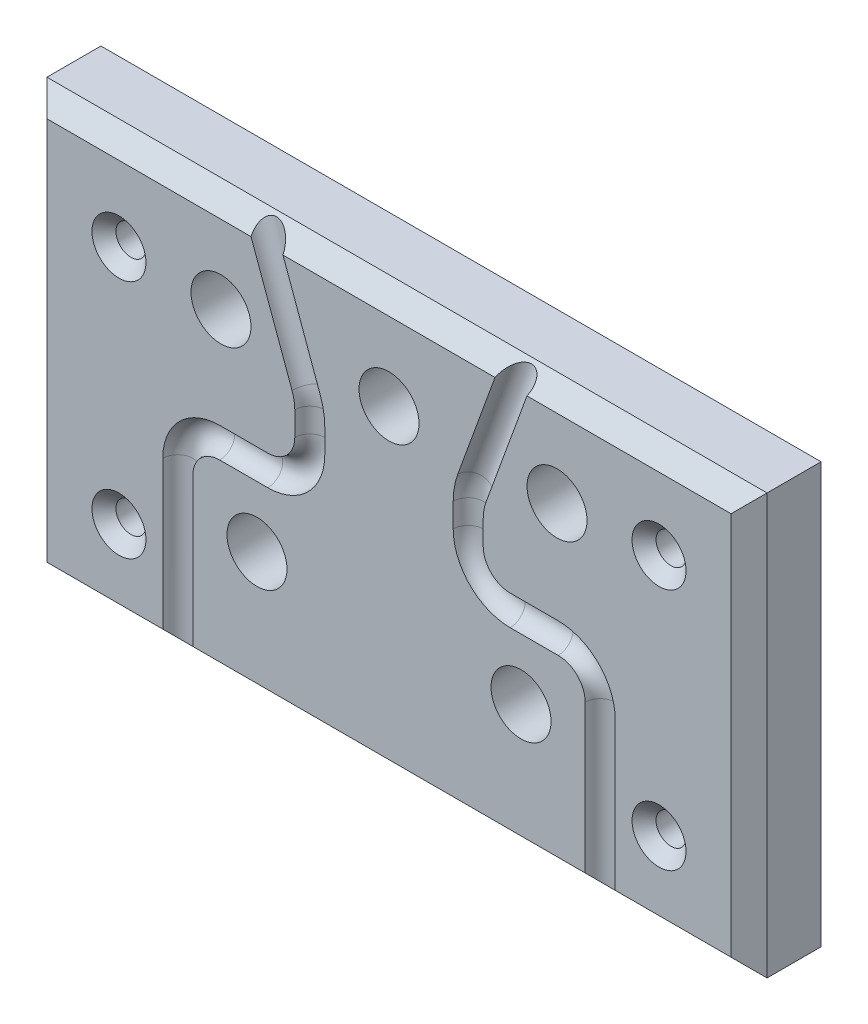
ISO-10303-21;
HEADER;
FILE_DESCRIPTION(('STEP AP214'),'2;1');
FILE_NAME('part.step','',(''),(''),'','','');
FILE_SCHEMA(('AUTOMOTIVE_DESIGN { 1 0 10303 214 1 1 1 1 }'));
ENDSEC;
DATA;
#1=APPLICATION_CONTEXT('core data for automotive mechanical design processes');
#2=APPLICATION_PROTOCOL_DEFINITION('international standard','automotive_design',2000,#1);
#3=PRODUCT_CONTEXT('',#1,'mechanical');
#4=PRODUCT('Part','Part','',(#3));
#5=PRODUCT_RELATED_PRODUCT_CATEGORY('part','',(#4));
#6=PRODUCT_DEFINITION_FORMATION('','',#4);
#7=PRODUCT_DEFINITION_CONTEXT('part definition',#1,'design');
#8=PRODUCT_DEFINITION('design','',#6,#7);
#9=PRODUCT_DEFINITION_SHAPE('','',#8);
#10=(LENGTH_UNIT() NAMED_UNIT(*) SI_UNIT(.MILLI.,.METRE.));
#11=(NAMED_UNIT(*) PLANE_ANGLE_UNIT() SI_UNIT($,.RADIAN.));
#12=(NAMED_UNIT(*) SI_UNIT($,.STERADIAN.) SOLID_ANGLE_UNIT());
#13=UNCERTAINTY_MEASURE_WITH_UNIT(LENGTH_MEASURE(1.E-05),#10,'distance_accuracy_value','');
#14=(GEOMETRIC_REPRESENTATION_CONTEXT(3) GLOBAL_UNCERTAINTY_ASSIGNED_CONTEXT((#13)) GLOBAL_UNIT_ASSIGNED_CONTEXT((#10,
#11,#12)) REPRESENTATION_CONTEXT('',''));
#15=CARTESIAN_POINT('',(0.,0.,0.));
#16=DIRECTION('',(0.,0.,1.));
#17=DIRECTION('',(1.,0.,0.));
#18=AXIS2_PLACEMENT_3D('',#15,#16,#17);
#19=CARTESIAN_POINT('',(-60.,-17.0716066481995,12.));
#20=DIRECTION('',(0.,0.,1.));
#21=DIRECTION('',(1.,0.,0.));
#22=AXIS2_PLACEMENT_3D('',#19,#20,#21);
#23=PLANE('',#22);
#24=CARTESIAN_POINT('',(-28.,36.9283933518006,12.));
#25=DIRECTION('',(0.,0.,1.));
#26=DIRECTION('',(1.,0.,0.));
#27=AXIS2_PLACEMENT_3D('',#24,#25,#26);
#28=CIRCLE('',#27,5.);
#29=CARTESIAN_POINT('',(-23.,36.9283933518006,12.));
#30=VERTEX_POINT('',#29);
#31=EDGE_CURVE('E382',#30,#30,#28,.T.);
#32=ORIENTED_EDGE('',*,*,#31,.F.);
#33=EDGE_LOOP('',(#32));
#34=FACE_BOUND('',#33,.T.);
#35=CARTESIAN_POINT('',(-45.,-2.57160664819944,12.));
#36=DIRECTION('',(0.,0.,1.));
#37=DIRECTION('',(1.,0.,0.));
#38=AXIS2_PLACEMENT_3D('',#35,#36,#37);
#39=CIRCLE('',#38,4.5);
#40=CARTESIAN_POINT('',(-40.5,-2.57160664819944,12.));
#41=VERTEX_POINT('',#40);
#42=EDGE_CURVE('E316',#41,#41,#39,.T.);
#43=ORIENTED_EDGE('',*,*,#42,.F.);
#44=EDGE_LOOP('',(#43));
#45=FACE_BOUND('',#44,.T.);
#46=CARTESIAN_POINT('',(-45.,37.4283933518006,12.));
#47=DIRECTION('',(0.,0.,1.));
#48=DIRECTION('',(1.,0.,0.));
#49=AXIS2_PLACEMENT_3D('',#46,#47,#48);
#50=CIRCLE('',#49,4.5);
#51=CARTESIAN_POINT('',(-40.5,37.4283933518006,12.));
#52=VERTEX_POINT('',#51);
#53=EDGE_CURVE('E289',#52,#52,#50,.T.);
#54=ORIENTED_EDGE('',*,*,#53,.F.);
#55=EDGE_LOOP('',(#54));
#56=FACE_BOUND('',#55,.T.);
#57=CARTESIAN_POINT('',(-23.1999999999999,28.5783933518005,12.));
#58=DIRECTION('',(0.,0.,-1.));
#59=DIRECTION('',(-1.,0.,0.));
#60=AXIS2_PLACEMENT_3D('',#57,#58,#59);
#61=CIRCLE('',#60,7.49999999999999);
#62=CARTESIAN_POINT('',(-16.1523053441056,31.1435444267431,12.));
#63=VERTEX_POINT('',#62);
#64=CARTESIAN_POINT('',(-15.7,28.5783933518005,12.));
#65=VERTEX_POINT('',#64);
#66=EDGE_CURVE('E184',#63,#65,#61,.T.);
#67=ORIENTED_EDGE('',*,*,#66,.F.);
#68=DIRECTION('',(0.342020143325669,-0.939692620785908,0.));
#69=VECTOR('',#68,1.);
#70=CARTESIAN_POINT('',(-28.2830267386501,64.472427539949,12.));
#71=LINE('',#70,#69);
#72=CARTESIAN_POINT('',(-22.9894312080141,49.9283933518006,12.));
#73=VERTEX_POINT('',#72);
#74=EDGE_CURVE('E190',#63,#73,#71,.F.);
#75=ORIENTED_EDGE('',*,*,#74,.T.);
#76=DIRECTION('',(-1.,0.,0.));
#77=VECTOR('',#76,1.);
#78=CARTESIAN_POINT('',(-60.,49.9283933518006,12.));
#79=LINE('',#78,#77);
#80=CARTESIAN_POINT('',(-57.,49.9283933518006,12.));
#81=VERTEX_POINT('',#80);
#82=EDGE_CURVE('E364',#73,#81,#79,.T.);
#83=ORIENTED_EDGE('',*,*,#82,.T.);
#84=DIRECTION('',(0.,-1.,0.));
#85=VECTOR('',#84,1.);
#86=CARTESIAN_POINT('',(-57.,-17.0716066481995,12.));
#87=LINE('',#86,#85);
#88=CARTESIAN_POINT('',(-57.,-14.0716066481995,12.));
#89=VERTEX_POINT('',#88);
#90=EDGE_CURVE('E356',#81,#89,#87,.T.);
#91=ORIENTED_EDGE('',*,*,#90,.T.);
#92=DIRECTION('',(1.,0.,0.));
#93=VECTOR('',#92,1.);
#94=CARTESIAN_POINT('',(60.,-14.0716066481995,12.));
#95=LINE('',#94,#93);
#96=CARTESIAN_POINT('',(-37.7,-14.0716066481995,12.));
#97=VERTEX_POINT('',#96);
#98=EDGE_CURVE('E359',#89,#97,#95,.T.);
#99=ORIENTED_EDGE('',*,*,#98,.T.);
#100=DIRECTION('',(0.,-1.,0.));
#101=VECTOR('',#100,1.);
#102=CARTESIAN_POINT('',(-37.7,10.5783933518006,12.));
#103=LINE('',#102,#101);
#104=CARTESIAN_POINT('',(-37.7,10.5783933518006,12.));
#105=VERTEX_POINT('',#104);
#106=EDGE_CURVE('E45',#97,#105,#103,.F.);
#107=ORIENTED_EDGE('',*,*,#106,.T.);
#108=CARTESIAN_POINT('',(-28.2,10.5783933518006,12.));
#109=DIRECTION('',(0.,0.,1.));
#110=DIRECTION('',(1.,0.,0.));
#111=AXIS2_PLACEMENT_3D('',#108,#109,#110);
#112=CIRCLE('',#111,9.50000000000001);
#113=CARTESIAN_POINT('',(-28.2,20.0783933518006,12.));
#114=VERTEX_POINT('',#113);
#115=EDGE_CURVE('E233',#114,#105,#112,.T.);
#116=ORIENTED_EDGE('',*,*,#115,.F.);
#117=DIRECTION('',(-1.,0.,0.));
#118=VECTOR('',#117,1.);
#119=CARTESIAN_POINT('',(-20.2,20.0783933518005,12.));
#120=LINE('',#119,#118);
#121=CARTESIAN_POINT('',(-20.2,20.0783933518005,12.));
#122=VERTEX_POINT('',#121);
#123=EDGE_CURVE('E225',#114,#122,#120,.F.);
#124=ORIENTED_EDGE('',*,*,#123,.T.);
#125=CARTESIAN_POINT('',(-20.2,24.5783933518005,12.));
#126=DIRECTION('',(0.,0.,-1.));
#127=DIRECTION('',(-1.,0.,0.));
#128=AXIS2_PLACEMENT_3D('',#125,#126,#127);
#129=CIRCLE('',#128,4.5);
#130=CARTESIAN_POINT('',(-15.7,24.5783933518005,12.));
#131=VERTEX_POINT('',#130);
#132=EDGE_CURVE('E214',#131,#122,#129,.T.);
#133=ORIENTED_EDGE('',*,*,#132,.F.);
#134=DIRECTION('',(0.,-1.,0.));
#135=VECTOR('',#134,1.);
#136=CARTESIAN_POINT('',(-15.7,28.5783933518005,12.));
#137=LINE('',#136,#135);
#138=EDGE_CURVE('E202',#131,#65,#137,.F.);
#139=ORIENTED_EDGE('',*,*,#138,.T.);
#140=EDGE_LOOP('',(#67,#75,#83,#91,#99,#107,#116,#124,#133,#139));
#141=FACE_BOUND('',#140,.T.);
#142=ADVANCED_FACE('F28',(#34,#45,#56,#141),#23,.T.);
#143=CARTESIAN_POINT('',(0.,36.9283933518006,12.));
#144=DIRECTION('',(0.,0.,1.));
#145=DIRECTION('',(1.,0.,0.));
#146=AXIS2_PLACEMENT_3D('',#143,#144,#145);
#147=CIRCLE('',#146,5.);
#148=CARTESIAN_POINT('',(5.,36.9283933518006,12.));
#149=VERTEX_POINT('',#148);
#150=EDGE_CURVE('E402',#149,#149,#147,.T.);
#151=ORIENTED_EDGE('',*,*,#150,.F.);
#152=EDGE_LOOP('',(#151));
#153=FACE_BOUND('',#152,.T.);
#154=CARTESIAN_POINT('',(22.,4.92839335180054,12.));
#155=DIRECTION('',(0.,0.,1.));
#156=DIRECTION('',(1.,0.,0.));
#157=AXIS2_PLACEMENT_3D('',#154,#155,#156);
#158=CIRCLE('',#157,5.);
#159=CARTESIAN_POINT('',(27.,4.92839335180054,12.));
#160=VERTEX_POINT('',#159);
#161=EDGE_CURVE('E392',#160,#160,#158,.T.);
#162=ORIENTED_EDGE('',*,*,#161,.F.);
#163=EDGE_LOOP('',(#162));
#164=FACE_BOUND('',#163,.T.);
#165=CARTESIAN_POINT('',(-22.,4.92839335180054,12.));
#166=DIRECTION('',(0.,0.,1.));
#167=DIRECTION('',(1.,0.,0.));
#168=AXIS2_PLACEMENT_3D('',#165,#166,#167);
#169=CIRCLE('',#168,5.);
#170=CARTESIAN_POINT('',(-17.,4.92839335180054,12.));
#171=VERTEX_POINT('',#170);
#172=EDGE_CURVE('E389',#171,#171,#169,.T.);
#173=ORIENTED_EDGE('',*,*,#172,.F.);
#174=EDGE_LOOP('',(#173));
#175=FACE_BOUND('',#174,.T.);
#176=CARTESIAN_POINT('',(17.6685423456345,49.9283933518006,12.));
#177=VERTEX_POINT('',#176);
#178=CARTESIAN_POINT('',(-17.6685423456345,49.9283933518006,12.));
#179=VERTEX_POINT('',#178);
#180=EDGE_CURVE('E369',#177,#179,#79,.T.);
#181=ORIENTED_EDGE('',*,*,#180,.T.);
#182=DIRECTION('',(0.342020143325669,-0.939692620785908,0.));
#183=VECTOR('',#182,1.);
#184=CARTESIAN_POINT('',(-23.5845636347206,66.1825282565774,12.));
#185=LINE('',#184,#183);
#186=CARTESIAN_POINT('',(-11.4538422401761,32.8536451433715,12.));
#187=VERTEX_POINT('',#186);
#188=EDGE_CURVE('E198',#179,#187,#185,.T.);
#189=ORIENTED_EDGE('',*,*,#188,.T.);
#190=CARTESIAN_POINT('',(-23.1999999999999,28.5783933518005,12.));
#191=DIRECTION('',(0.,0.,1.));
#192=DIRECTION('',(1.,0.,0.));
#193=AXIS2_PLACEMENT_3D('',#190,#191,#192);
#194=CIRCLE('',#193,12.5);
#195=CARTESIAN_POINT('',(-10.7,28.5783933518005,12.));
#196=VERTEX_POINT('',#195);
#197=EDGE_CURVE('E187',#196,#187,#194,.T.);
#198=ORIENTED_EDGE('',*,*,#197,.F.);
#199=DIRECTION('',(0.,-1.,0.));
#200=VECTOR('',#199,1.);
#201=CARTESIAN_POINT('',(-10.7,28.5783933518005,12.));
#202=LINE('',#201,#200);
#203=CARTESIAN_POINT('',(-10.7,24.5783933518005,12.));
#204=VERTEX_POINT('',#203);
#205=EDGE_CURVE('E208',#196,#204,#202,.T.);
#206=ORIENTED_EDGE('',*,*,#205,.T.);
#207=CARTESIAN_POINT('',(-20.2,24.5783933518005,12.));
#208=DIRECTION('',(0.,0.,1.));
#209=DIRECTION('',(1.,0.,0.));
#210=AXIS2_PLACEMENT_3D('',#207,#208,#209);
#211=CIRCLE('',#210,9.5);
#212=CARTESIAN_POINT('',(-20.2,15.0783933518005,12.));
#213=VERTEX_POINT('',#212);
#214=EDGE_CURVE('E217',#213,#204,#211,.T.);
#215=ORIENTED_EDGE('',*,*,#214,.F.);
#216=DIRECTION('',(-1.,0.,0.));
#217=VECTOR('',#216,1.);
#218=CARTESIAN_POINT('',(-20.2,15.0783933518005,12.));
#219=LINE('',#218,#217);
#220=CARTESIAN_POINT('',(-28.2,15.0783933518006,12.));
#221=VERTEX_POINT('',#220);
#222=EDGE_CURVE('E222',#213,#221,#219,.T.);
#223=ORIENTED_EDGE('',*,*,#222,.T.);
#224=CARTESIAN_POINT('',(-28.2,10.5783933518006,12.));
#225=DIRECTION('',(0.,0.,-1.));
#226=DIRECTION('',(-1.,0.,0.));
#227=AXIS2_PLACEMENT_3D('',#224,#225,#226);
#228=CIRCLE('',#227,4.5);
#229=CARTESIAN_POINT('',(-32.7,10.5783933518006,12.));
#230=VERTEX_POINT('',#229);
#231=EDGE_CURVE('E230',#230,#221,#228,.T.);
#232=ORIENTED_EDGE('',*,*,#231,.F.);
#233=DIRECTION('',(0.,-1.,0.));
#234=VECTOR('',#233,1.);
#235=CARTESIAN_POINT('',(-32.7,10.5783933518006,12.));
#236=LINE('',#235,#234);
#237=CARTESIAN_POINT('',(-32.7,-14.0716066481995,12.));
#238=VERTEX_POINT('',#237);
#239=EDGE_CURVE('E238',#230,#238,#236,.T.);
#240=ORIENTED_EDGE('',*,*,#239,.T.);
#241=CARTESIAN_POINT('',(32.7,-14.0716066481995,12.));
#242=VERTEX_POINT('',#241);
#243=EDGE_CURVE('E52',#238,#242,#95,.T.);
#244=ORIENTED_EDGE('',*,*,#243,.T.);
#245=DIRECTION('',(0.,-1.,0.));
#246=VECTOR('',#245,1.);
#247=CARTESIAN_POINT('',(32.7,10.5783933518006,12.));
#248=LINE('',#247,#246);
#249=CARTESIAN_POINT('',(32.7,10.5783933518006,12.));
#250=VERTEX_POINT('',#249);
#251=EDGE_CURVE('E287',#250,#242,#248,.T.);
#252=ORIENTED_EDGE('',*,*,#251,.F.);
#253=CARTESIAN_POINT('',(28.2,10.5783933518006,12.));
#254=DIRECTION('',(0.,0.,-1.));
#255=DIRECTION('',(-1.,0.,0.));
#256=AXIS2_PLACEMENT_3D('',#253,#254,#255);
#257=CIRCLE('',#256,4.5);
#258=CARTESIAN_POINT('',(28.2,15.0783933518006,12.));
#259=VERTEX_POINT('',#258);
#260=EDGE_CURVE('E277',#259,#250,#257,.T.);
#261=ORIENTED_EDGE('',*,*,#260,.F.);
#262=DIRECTION('',(1.,0.,0.));
#263=VECTOR('',#262,1.);
#264=CARTESIAN_POINT('',(20.2,15.0783933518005,12.));
#265=LINE('',#264,#263);
#266=CARTESIAN_POINT('',(20.2,15.0783933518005,12.));
#267=VERTEX_POINT('',#266);
#268=EDGE_CURVE('E273',#267,#259,#265,.T.);
#269=ORIENTED_EDGE('',*,*,#268,.F.);
#270=CARTESIAN_POINT('',(20.2,24.5783933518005,12.));
#271=DIRECTION('',(0.,0.,1.));
#272=DIRECTION('',(1.,0.,0.));
#273=AXIS2_PLACEMENT_3D('',#270,#271,#272);
#274=CIRCLE('',#273,9.5);
#275=CARTESIAN_POINT('',(10.7,24.5783933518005,12.));
#276=VERTEX_POINT('',#275);
#277=EDGE_CURVE('E266',#276,#267,#274,.T.);
#278=ORIENTED_EDGE('',*,*,#277,.F.);
#279=DIRECTION('',(0.,-1.,0.));
#280=VECTOR('',#279,1.);
#281=CARTESIAN_POINT('',(10.7,28.5783933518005,12.));
#282=LINE('',#281,#280);
#283=CARTESIAN_POINT('',(10.7,28.5783933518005,12.));
#284=VERTEX_POINT('',#283);
#285=EDGE_CURVE('E259',#284,#276,#282,.T.);
#286=ORIENTED_EDGE('',*,*,#285,.F.);
#287=CARTESIAN_POINT('',(23.1999999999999,28.5783933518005,12.));
#288=DIRECTION('',(0.,0.,1.));
#289=DIRECTION('',(1.,0.,0.));
#290=AXIS2_PLACEMENT_3D('',#287,#288,#289);
#291=CIRCLE('',#290,12.5);
#292=CARTESIAN_POINT('',(11.4538422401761,32.8536451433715,12.));
#293=VERTEX_POINT('',#292);
#294=EDGE_CURVE('E252',#293,#284,#291,.T.);
#295=ORIENTED_EDGE('',*,*,#294,.F.);
#296=DIRECTION('',(-0.342020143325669,-0.939692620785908,0.));
#297=VECTOR('',#296,1.);
#298=CARTESIAN_POINT('',(23.5845636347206,66.1825282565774,12.));
#299=LINE('',#298,#297);
#300=EDGE_CURVE('E245',#177,#293,#299,.T.);
#301=ORIENTED_EDGE('',*,*,#300,.F.);
#302=EDGE_LOOP('',(#181,#189,#198,#206,#215,#223,#232,#240,#244,#252,#261,#269,#278,#286,#295,#301));
#303=FACE_BOUND('',#302,.T.);
#304=ADVANCED_FACE('F411',(#153,#164,#175,#303),#23,.T.);
#305=CARTESIAN_POINT('',(-60.,49.9283933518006,12.));
#306=DIRECTION('',(0.,0.70710678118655,0.707106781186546));
#307=DIRECTION('',(0.,-0.707106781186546,0.70710678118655));
#308=AXIS2_PLACEMENT_3D('',#305,#306,#307);
#309=PLANE('',#308);
#310=ORIENTED_EDGE('',*,*,#82,.F.);
#311=CARTESIAN_POINT('',(-20.3289867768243,49.9283933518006,12.));
#312=DIRECTION('',(0.,0.70710678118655,0.707106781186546));
#313=DIRECTION('',(0.457661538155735,-0.628707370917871,0.628707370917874));
#314=AXIS2_PLACEMENT_3D('',#311,#312,#313);
#315=ELLIPSE('',#314,3.76243659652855,2.5);
#316=EDGE_CURVE('E195',#73,#179,#315,.F.);
#317=ORIENTED_EDGE('',*,*,#316,.T.);
#318=ORIENTED_EDGE('',*,*,#180,.F.);
#319=CARTESIAN_POINT('',(20.3289867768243,49.9283933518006,12.));
#320=DIRECTION('',(0.,0.70710678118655,0.707106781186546));
#321=DIRECTION('',(-0.457661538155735,-0.628707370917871,0.628707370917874));
#322=AXIS2_PLACEMENT_3D('',#319,#320,#321);
#323=ELLIPSE('',#322,3.76243659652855,2.5);
#324=CARTESIAN_POINT('',(22.9894312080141,49.9283933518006,12.));
#325=VERTEX_POINT('',#324);
#326=EDGE_CURVE('E241',#325,#177,#323,.T.);
#327=ORIENTED_EDGE('',*,*,#326,.F.);
#328=CARTESIAN_POINT('',(57.,49.9283933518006,12.));
#329=VERTEX_POINT('',#328);
#330=EDGE_CURVE('E365',#329,#325,#79,.T.);
#331=ORIENTED_EDGE('',*,*,#330,.F.);
#332=DIRECTION('',(-0.577350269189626,-0.577350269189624,0.577350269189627));
#333=VECTOR('',#332,1.);
#334=CARTESIAN_POINT('',(34.6666666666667,27.5950600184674,34.3333333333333));
#335=LINE('',#334,#333);
#336=CARTESIAN_POINT('',(60.,52.9283933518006,8.99999999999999));
#337=VERTEX_POINT('',#336);
#338=EDGE_CURVE('E328',#329,#337,#335,.F.);
#339=ORIENTED_EDGE('',*,*,#338,.T.);
#340=DIRECTION('',(1.,0.,0.));
#341=VECTOR('',#340,1.);
#342=CARTESIAN_POINT('',(60.,52.9283933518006,8.99999999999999));
#343=LINE('',#342,#341);
#344=CARTESIAN_POINT('',(-60.,52.9283933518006,8.99999999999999));
#345=VERTEX_POINT('',#344);
#346=EDGE_CURVE('E368',#345,#337,#343,.T.);
#347=ORIENTED_EDGE('',*,*,#346,.F.);
#348=DIRECTION('',(-0.577350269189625,0.577350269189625,-0.577350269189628));
#349=VECTOR('',#348,1.);
#350=CARTESIAN_POINT('',(-34.6666666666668,27.5950600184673,34.3333333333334));
#351=LINE('',#350,#349);
#352=EDGE_CURVE('E325',#345,#81,#351,.F.);
#353=ORIENTED_EDGE('',*,*,#352,.T.);
#354=EDGE_LOOP('',(#310,#317,#318,#327,#331,#339,#347,#353));
#355=FACE_BOUND('',#354,.T.);
#356=ADVANCED_FACE('F416',(#355),#309,.T.);
#357=CARTESIAN_POINT('',(-60.,-14.0716066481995,12.));
#358=DIRECTION('',(0.,-0.70710678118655,0.707106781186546));
#359=DIRECTION('',(0.,-0.707106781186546,-0.70710678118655));
#360=AXIS2_PLACEMENT_3D('',#357,#358,#359);
#361=PLANE('',#360);
#362=ORIENTED_EDGE('',*,*,#243,.F.);
#363=CARTESIAN_POINT('',(-35.2,-14.0716066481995,12.));
#364=DIRECTION('',(0.,-0.70710678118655,0.707106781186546));
#365=DIRECTION('',(0.,-0.707106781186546,-0.70710678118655));
#366=AXIS2_PLACEMENT_3D('',#363,#364,#365);
#367=ELLIPSE('',#366,3.53553390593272,2.49999999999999);
#368=EDGE_CURVE('E11',#238,#97,#367,.F.);
#369=ORIENTED_EDGE('',*,*,#368,.T.);
#370=ORIENTED_EDGE('',*,*,#98,.F.);
#371=DIRECTION('',(0.577350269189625,0.577350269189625,0.577350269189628));
#372=VECTOR('',#371,1.);
#373=CARTESIAN_POINT('',(-58.,-15.0716066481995,11.));
#374=LINE('',#373,#372);
#375=CARTESIAN_POINT('',(-60.,-17.0716066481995,8.99999999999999));
#376=VERTEX_POINT('',#375);
#377=EDGE_CURVE('E330',#376,#89,#374,.T.);
#378=ORIENTED_EDGE('',*,*,#377,.F.);
#379=DIRECTION('',(-1.,0.,0.));
#380=VECTOR('',#379,1.);
#381=CARTESIAN_POINT('',(-60.,-17.0716066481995,8.99999999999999));
#382=LINE('',#381,#380);
#383=CARTESIAN_POINT('',(60.,-17.0716066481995,8.99999999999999));
#384=VERTEX_POINT('',#383);
#385=EDGE_CURVE('E374',#384,#376,#382,.T.);
#386=ORIENTED_EDGE('',*,*,#385,.F.);
#387=DIRECTION('',(-0.577350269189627,0.577350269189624,0.577350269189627));
#388=VECTOR('',#387,1.);
#389=CARTESIAN_POINT('',(17.9999999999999,24.9283933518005,51.0000000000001));
#390=LINE('',#389,#388);
#391=CARTESIAN_POINT('',(57.,-14.0716066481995,12.));
#392=VERTEX_POINT('',#391);
#393=EDGE_CURVE('E333',#392,#384,#390,.F.);
#394=ORIENTED_EDGE('',*,*,#393,.F.);
#395=CARTESIAN_POINT('',(37.7,-14.0716066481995,12.));
#396=VERTEX_POINT('',#395);
#397=EDGE_CURVE('E358',#396,#392,#95,.T.);
#398=ORIENTED_EDGE('',*,*,#397,.F.);
#399=CARTESIAN_POINT('',(35.2,-14.0716066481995,12.));
#400=DIRECTION('',(0.,-0.70710678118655,0.707106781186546));
#401=DIRECTION('',(0.,-0.707106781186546,-0.70710678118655));
#402=AXIS2_PLACEMENT_3D('',#399,#400,#401);
#403=ELLIPSE('',#402,3.53553390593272,2.49999999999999);
#404=EDGE_CURVE('E37',#242,#396,#403,.T.);
#405=ORIENTED_EDGE('',*,*,#404,.F.);
#406=EDGE_LOOP('',(#362,#369,#370,#378,#386,#394,#398,#405));
#407=FACE_BOUND('',#406,.T.);
#408=ADVANCED_FACE('F425',(#407),#361,.T.);
#409=CARTESIAN_POINT('',(-60.,52.9283933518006,12.));
#410=DIRECTION('',(1.,0.,0.));
#411=DIRECTION('',(0.,0.,-1.));
#412=AXIS2_PLACEMENT_3D('',#409,#410,#411);
#413=PLANE('',#412);
#414=DIRECTION('',(0.,0.,-1.));
#415=VECTOR('',#414,1.);
#416=CARTESIAN_POINT('',(-60.,-17.0716066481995,12.));
#417=LINE('',#416,#415);
#418=CARTESIAN_POINT('',(-60.,-17.0716066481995,0.));
#419=VERTEX_POINT('',#418);
#420=EDGE_CURVE('E354',#376,#419,#417,.T.);
#421=ORIENTED_EDGE('',*,*,#420,.F.);
#422=DIRECTION('',(0.,1.,0.));
#423=VECTOR('',#422,1.);
#424=CARTESIAN_POINT('',(-60.,52.9283933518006,8.99999999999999));
#425=LINE('',#424,#423);
#426=EDGE_CURVE('E376',#376,#345,#425,.T.);
#427=ORIENTED_EDGE('',*,*,#426,.T.);
#428=DIRECTION('',(0.,0.,-1.));
#429=VECTOR('',#428,1.);
#430=CARTESIAN_POINT('',(-60.,52.9283933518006,12.));
#431=LINE('',#430,#429);
#432=CARTESIAN_POINT('',(-60.,52.9283933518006,0.));
#433=VERTEX_POINT('',#432);
#434=EDGE_CURVE('E348',#345,#433,#431,.T.);
#435=ORIENTED_EDGE('',*,*,#434,.T.);
#436=DIRECTION('',(0.,-1.,0.));
#437=VECTOR('',#436,1.);
#438=CARTESIAN_POINT('',(-60.,52.9283933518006,0.));
#439=LINE('',#438,#437);
#440=EDGE_CURVE('E336',#433,#419,#439,.T.);
#441=ORIENTED_EDGE('',*,*,#440,.T.);
#442=EDGE_LOOP('',(#421,#427,#435,#441));
#443=FACE_BOUND('',#442,.T.);
#444=ADVANCED_FACE('F30',(#443),#413,.F.);
#445=CARTESIAN_POINT('',(-60.,-17.0716066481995,12.));
#446=DIRECTION('',(0.,1.,0.));
#447=DIRECTION('',(0.,0.,1.));
#448=AXIS2_PLACEMENT_3D('',#445,#446,#447);
#449=PLANE('',#448);
#450=DIRECTION('',(0.,0.,-1.));
#451=VECTOR('',#450,1.);
#452=CARTESIAN_POINT('',(60.,-17.0716066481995,12.));
#453=LINE('',#452,#451);
#454=CARTESIAN_POINT('',(60.,-17.0716066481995,0.));
#455=VERTEX_POINT('',#454);
#456=EDGE_CURVE('E352',#384,#455,#453,.T.);
#457=ORIENTED_EDGE('',*,*,#456,.F.);
#458=ORIENTED_EDGE('',*,*,#385,.T.);
#459=ORIENTED_EDGE('',*,*,#420,.T.);
#460=DIRECTION('',(1.,0.,0.));
#461=VECTOR('',#460,1.);
#462=CARTESIAN_POINT('',(-60.,-17.0716066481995,0.));
#463=LINE('',#462,#461);
#464=EDGE_CURVE('E339',#419,#455,#463,.T.);
#465=ORIENTED_EDGE('',*,*,#464,.T.);
#466=EDGE_LOOP('',(#457,#458,#459,#465));
#467=FACE_BOUND('',#466,.T.);
#468=ADVANCED_FACE('F448',(#467),#449,.F.);
#469=CARTESIAN_POINT('',(60.,52.9283933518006,12.));
#470=DIRECTION('',(-1.,0.,0.));
#471=DIRECTION('',(0.,-1.,0.));
#472=AXIS2_PLACEMENT_3D('',#469,#470,#471);
#473=PLANE('',#472);
#474=DIRECTION('',(0.,0.,-1.));
#475=VECTOR('',#474,1.);
#476=CARTESIAN_POINT('',(60.,52.9283933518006,12.));
#477=LINE('',#476,#475);
#478=CARTESIAN_POINT('',(60.,52.9283933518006,0.));
#479=VERTEX_POINT('',#478);
#480=EDGE_CURVE('E350',#337,#479,#477,.T.);
#481=ORIENTED_EDGE('',*,*,#480,.F.);
#482=DIRECTION('',(0.,-1.,0.));
#483=VECTOR('',#482,1.);
#484=CARTESIAN_POINT('',(60.,-17.0716066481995,8.99999999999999));
#485=LINE('',#484,#483);
#486=EDGE_CURVE('E372',#337,#384,#485,.T.);
#487=ORIENTED_EDGE('',*,*,#486,.T.);
#488=ORIENTED_EDGE('',*,*,#456,.T.);
#489=DIRECTION('',(0.,1.,0.));
#490=VECTOR('',#489,1.);
#491=CARTESIAN_POINT('',(60.,52.9283933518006,0.));
#492=LINE('',#491,#490);
#493=EDGE_CURVE('E342',#455,#479,#492,.T.);
#494=ORIENTED_EDGE('',*,*,#493,.T.);
#495=EDGE_LOOP('',(#481,#487,#488,#494));
#496=FACE_BOUND('',#495,.T.);
#497=ADVANCED_FACE('F446',(#496),#473,.F.);
#498=CARTESIAN_POINT('',(-60.,52.9283933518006,12.));
#499=DIRECTION('',(0.,-1.,0.));
#500=DIRECTION('',(1.,0.,0.));
#501=AXIS2_PLACEMENT_3D('',#498,#499,#500);
#502=PLANE('',#501);
#503=ORIENTED_EDGE('',*,*,#434,.F.);
#504=ORIENTED_EDGE('',*,*,#346,.T.);
#505=ORIENTED_EDGE('',*,*,#480,.T.);
#506=DIRECTION('',(-1.,0.,0.));
#507=VECTOR('',#506,1.);
#508=CARTESIAN_POINT('',(-60.,52.9283933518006,0.));
#509=LINE('',#508,#507);
#510=EDGE_CURVE('E345',#479,#433,#509,.T.);
#511=ORIENTED_EDGE('',*,*,#510,.T.);
#512=EDGE_LOOP('',(#503,#504,#505,#511));
#513=FACE_BOUND('',#512,.T.);
#514=ADVANCED_FACE('F433',(#513),#502,.F.);
#515=CARTESIAN_POINT('',(28.,36.9283933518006,12.));
#516=DIRECTION('',(0.,0.,1.));
#517=DIRECTION('',(1.,0.,0.));
#518=AXIS2_PLACEMENT_3D('',#515,#516,#517);
#519=CIRCLE('',#518,5.);
#520=CARTESIAN_POINT('',(33.,36.9283933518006,12.));
#521=VERTEX_POINT('',#520);
#522=EDGE_CURVE('E386',#521,#521,#519,.T.);
#523=ORIENTED_EDGE('',*,*,#522,.F.);
#524=EDGE_LOOP('',(#523));
#525=FACE_BOUND('',#524,.T.);
#526=DIRECTION('',(-0.342020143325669,-0.939692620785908,0.));
#527=VECTOR('',#526,1.);
#528=CARTESIAN_POINT('',(28.2830267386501,64.472427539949,12.));
#529=LINE('',#528,#527);
#530=CARTESIAN_POINT('',(16.1523053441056,31.1435444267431,12.));
#531=VERTEX_POINT('',#530);
#532=EDGE_CURVE('E243',#531,#325,#529,.F.);
#533=ORIENTED_EDGE('',*,*,#532,.F.);
#534=CARTESIAN_POINT('',(23.1999999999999,28.5783933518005,12.));
#535=DIRECTION('',(0.,0.,-1.));
#536=DIRECTION('',(-1.,0.,0.));
#537=AXIS2_PLACEMENT_3D('',#534,#535,#536);
#538=CIRCLE('',#537,7.49999999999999);
#539=CARTESIAN_POINT('',(15.7,28.5783933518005,12.));
#540=VERTEX_POINT('',#539);
#541=EDGE_CURVE('E249',#540,#531,#538,.T.);
#542=ORIENTED_EDGE('',*,*,#541,.F.);
#543=DIRECTION('',(0.,-1.,0.));
#544=VECTOR('',#543,1.);
#545=CARTESIAN_POINT('',(15.7,28.5783933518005,12.));
#546=LINE('',#545,#544);
#547=CARTESIAN_POINT('',(15.7,24.5783933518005,12.));
#548=VERTEX_POINT('',#547);
#549=EDGE_CURVE('E256',#548,#540,#546,.F.);
#550=ORIENTED_EDGE('',*,*,#549,.F.);
#551=CARTESIAN_POINT('',(20.2,24.5783933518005,12.));
#552=DIRECTION('',(0.,0.,-1.));
#553=DIRECTION('',(-1.,0.,0.));
#554=AXIS2_PLACEMENT_3D('',#551,#552,#553);
#555=CIRCLE('',#554,4.5);
#556=CARTESIAN_POINT('',(20.2,20.0783933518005,12.));
#557=VERTEX_POINT('',#556);
#558=EDGE_CURVE('E263',#557,#548,#555,.T.);
#559=ORIENTED_EDGE('',*,*,#558,.F.);
#560=DIRECTION('',(1.,0.,0.));
#561=VECTOR('',#560,1.);
#562=CARTESIAN_POINT('',(20.2,20.0783933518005,12.));
#563=LINE('',#562,#561);
#564=CARTESIAN_POINT('',(28.2,20.0783933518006,12.));
#565=VERTEX_POINT('',#564);
#566=EDGE_CURVE('E270',#565,#557,#563,.F.);
#567=ORIENTED_EDGE('',*,*,#566,.F.);
#568=CARTESIAN_POINT('',(28.2,10.5783933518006,12.));
#569=DIRECTION('',(0.,0.,1.));
#570=DIRECTION('',(1.,0.,0.));
#571=AXIS2_PLACEMENT_3D('',#568,#569,#570);
#572=CIRCLE('',#571,9.50000000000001);
#573=CARTESIAN_POINT('',(37.7,10.5783933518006,12.));
#574=VERTEX_POINT('',#573);
#575=EDGE_CURVE('E279',#574,#565,#572,.T.);
#576=ORIENTED_EDGE('',*,*,#575,.F.);
#577=DIRECTION('',(0.,-1.,0.));
#578=VECTOR('',#577,1.);
#579=CARTESIAN_POINT('',(37.7,10.5783933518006,12.));
#580=LINE('',#579,#578);
#581=EDGE_CURVE('E284',#396,#574,#580,.F.);
#582=ORIENTED_EDGE('',*,*,#581,.F.);
#583=ORIENTED_EDGE('',*,*,#397,.T.);
#584=DIRECTION('',(0.,1.,0.));
#585=VECTOR('',#584,1.);
#586=CARTESIAN_POINT('',(57.,52.9283933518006,12.));
#587=LINE('',#586,#585);
#588=EDGE_CURVE('E362',#392,#329,#587,.T.);
#589=ORIENTED_EDGE('',*,*,#588,.T.);
#590=ORIENTED_EDGE('',*,*,#330,.T.);
#591=EDGE_LOOP('',(#533,#542,#550,#559,#567,#576,#582,#583,#589,#590));
#592=FACE_BOUND('',#591,.T.);
#593=CARTESIAN_POINT('',(45.,37.9283933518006,12.));
#594=DIRECTION('',(0.,0.,1.));
#595=DIRECTION('',(1.,0.,0.));
#596=AXIS2_PLACEMENT_3D('',#593,#594,#595);
#597=CIRCLE('',#596,4.5);
#598=CARTESIAN_POINT('',(49.5,37.9283933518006,12.));
#599=VERTEX_POINT('',#598);
#600=EDGE_CURVE('E298',#599,#599,#597,.T.);
#601=ORIENTED_EDGE('',*,*,#600,.F.);
#602=EDGE_LOOP('',(#601));
#603=FACE_BOUND('',#602,.T.);
#604=CARTESIAN_POINT('',(45.,-2.57160664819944,12.));
#605=DIRECTION('',(0.,0.,1.));
#606=DIRECTION('',(1.,0.,0.));
#607=AXIS2_PLACEMENT_3D('',#604,#605,#606);
#608=CIRCLE('',#607,4.5);
#609=CARTESIAN_POINT('',(49.5,-2.57160664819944,12.));
#610=VERTEX_POINT('',#609);
#611=EDGE_CURVE('E307',#610,#610,#608,.T.);
#612=ORIENTED_EDGE('',*,*,#611,.F.);
#613=EDGE_LOOP('',(#612));
#614=FACE_BOUND('',#613,.T.);
#615=ADVANCED_FACE('F455',(#525,#592,#603,#614),#23,.T.);
#616=CARTESIAN_POINT('',(-60.,-17.0716066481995,0.));
#617=DIRECTION('',(0.,0.,1.));
#618=DIRECTION('',(1.,0.,0.));
#619=AXIS2_PLACEMENT_3D('',#616,#617,#618);
#620=PLANE('',#619);
#621=CARTESIAN_POINT('',(0.,36.9283933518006,0.));
#622=DIRECTION('',(0.,0.,1.));
#623=DIRECTION('',(1.,0.,0.));
#624=AXIS2_PLACEMENT_3D('',#621,#622,#623);
#625=CIRCLE('',#624,5.);
#626=CARTESIAN_POINT('',(5.,36.9283933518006,0.));
#627=VERTEX_POINT('',#626);
#628=EDGE_CURVE('E32',#627,#627,#625,.T.);
#629=ORIENTED_EDGE('',*,*,#628,.T.);
#630=EDGE_LOOP('',(#629));
#631=FACE_BOUND('',#630,.T.);
#632=CARTESIAN_POINT('',(22.,4.92839335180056,0.));
#633=DIRECTION('',(0.,0.,1.));
#634=DIRECTION('',(1.,0.,0.));
#635=AXIS2_PLACEMENT_3D('',#632,#633,#634);
#636=CIRCLE('',#635,5.);
#637=CARTESIAN_POINT('',(27.,4.92839335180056,0.));
#638=VERTEX_POINT('',#637);
#639=EDGE_CURVE('E390',#638,#638,#636,.T.);
#640=ORIENTED_EDGE('',*,*,#639,.T.);
#641=EDGE_LOOP('',(#640));
#642=FACE_BOUND('',#641,.T.);
#643=CARTESIAN_POINT('',(-22.,4.92839335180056,0.));
#644=DIRECTION('',(0.,0.,1.));
#645=DIRECTION('',(1.,0.,0.));
#646=AXIS2_PLACEMENT_3D('',#643,#644,#645);
#647=CIRCLE('',#646,5.);
#648=CARTESIAN_POINT('',(-17.,4.92839335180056,0.));
#649=VERTEX_POINT('',#648);
#650=EDGE_CURVE('E387',#649,#649,#647,.T.);
#651=ORIENTED_EDGE('',*,*,#650,.T.);
#652=EDGE_LOOP('',(#651));
#653=FACE_BOUND('',#652,.T.);
#654=CARTESIAN_POINT('',(28.,36.9283933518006,0.));
#655=DIRECTION('',(0.,0.,1.));
#656=DIRECTION('',(1.,0.,0.));
#657=AXIS2_PLACEMENT_3D('',#654,#655,#656);
#658=CIRCLE('',#657,5.);
#659=CARTESIAN_POINT('',(33.,36.9283933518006,0.));
#660=VERTEX_POINT('',#659);
#661=EDGE_CURVE('E383',#660,#660,#658,.T.);
#662=ORIENTED_EDGE('',*,*,#661,.T.);
#663=EDGE_LOOP('',(#662));
#664=FACE_BOUND('',#663,.T.);
#665=CARTESIAN_POINT('',(-28.,36.9283933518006,0.));
#666=DIRECTION('',(0.,0.,1.));
#667=DIRECTION('',(1.,0.,0.));
#668=AXIS2_PLACEMENT_3D('',#665,#666,#667);
#669=CIRCLE('',#668,5.);
#670=CARTESIAN_POINT('',(-23.,36.9283933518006,0.));
#671=VERTEX_POINT('',#670);
#672=EDGE_CURVE('E379',#671,#671,#669,.T.);
#673=ORIENTED_EDGE('',*,*,#672,.T.);
#674=EDGE_LOOP('',(#673));
#675=FACE_BOUND('',#674,.T.);
#676=CARTESIAN_POINT('',(-45.,37.4283933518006,0.));
#677=DIRECTION('',(0.,0.,1.));
#678=DIRECTION('',(1.,0.,0.));
#679=AXIS2_PLACEMENT_3D('',#676,#677,#678);
#680=CIRCLE('',#679,2.49999999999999);
#681=CARTESIAN_POINT('',(-42.5,37.4283933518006,0.));
#682=VERTEX_POINT('',#681);
#683=EDGE_CURVE('E295',#682,#682,#680,.T.);
#684=ORIENTED_EDGE('',*,*,#683,.T.);
#685=EDGE_LOOP('',(#684));
#686=FACE_BOUND('',#685,.T.);
#687=CARTESIAN_POINT('',(45.,37.9283933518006,0.));
#688=DIRECTION('',(0.,0.,1.));
#689=DIRECTION('',(1.,0.,0.));
#690=AXIS2_PLACEMENT_3D('',#687,#688,#689);
#691=CIRCLE('',#690,2.49999999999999);
#692=CARTESIAN_POINT('',(47.5,37.9283933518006,0.));
#693=VERTEX_POINT('',#692);
#694=EDGE_CURVE('E304',#693,#693,#691,.T.);
#695=ORIENTED_EDGE('',*,*,#694,.T.);
#696=EDGE_LOOP('',(#695));
#697=FACE_BOUND('',#696,.T.);
#698=CARTESIAN_POINT('',(45.,-2.57160664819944,0.));
#699=DIRECTION('',(0.,0.,1.));
#700=DIRECTION('',(1.,0.,0.));
#701=AXIS2_PLACEMENT_3D('',#698,#699,#700);
#702=CIRCLE('',#701,2.49999999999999);
#703=CARTESIAN_POINT('',(47.5,-2.57160664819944,0.));
#704=VERTEX_POINT('',#703);
#705=EDGE_CURVE('E313',#704,#704,#702,.T.);
#706=ORIENTED_EDGE('',*,*,#705,.T.);
#707=EDGE_LOOP('',(#706));
#708=FACE_BOUND('',#707,.T.);
#709=CARTESIAN_POINT('',(-45.,-2.57160664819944,0.));
#710=DIRECTION('',(0.,0.,1.));
#711=DIRECTION('',(1.,0.,0.));
#712=AXIS2_PLACEMENT_3D('',#709,#710,#711);
#713=CIRCLE('',#712,2.49999999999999);
#714=CARTESIAN_POINT('',(-42.5,-2.57160664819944,0.));
#715=VERTEX_POINT('',#714);
#716=EDGE_CURVE('E322',#715,#715,#713,.T.);
#717=ORIENTED_EDGE('',*,*,#716,.T.);
#718=EDGE_LOOP('',(#717));
#719=FACE_BOUND('',#718,.T.);
#720=ORIENTED_EDGE('',*,*,#440,.F.);
#721=ORIENTED_EDGE('',*,*,#510,.F.);
#722=ORIENTED_EDGE('',*,*,#493,.F.);
#723=ORIENTED_EDGE('',*,*,#464,.F.);
#724=EDGE_LOOP('',(#720,#721,#722,#723));
#725=FACE_BOUND('',#724,.T.);
#726=ADVANCED_FACE('F512',(#631,#642,#653,#664,#675,#686,#697,#708,#719,#725),#620,.F.);
#727=CARTESIAN_POINT('',(57.,-17.0716066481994,12.));
#728=DIRECTION('',(0.707106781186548,0.,0.707106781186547));
#729=DIRECTION('',(0.707106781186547,0.,-0.707106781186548));
#730=AXIS2_PLACEMENT_3D('',#727,#728,#729);
#731=PLANE('',#730);
#732=ORIENTED_EDGE('',*,*,#393,.T.);
#733=ORIENTED_EDGE('',*,*,#486,.F.);
#734=ORIENTED_EDGE('',*,*,#338,.F.);
#735=ORIENTED_EDGE('',*,*,#588,.F.);
#736=EDGE_LOOP('',(#732,#733,#734,#735));
#737=FACE_BOUND('',#736,.T.);
#738=ADVANCED_FACE('F442',(#737),#731,.T.);
#739=CARTESIAN_POINT('',(-57.,-17.0716066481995,12.));
#740=DIRECTION('',(-0.70710678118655,0.,0.707106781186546));
#741=DIRECTION('',(0.707106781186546,0.,0.70710678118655));
#742=AXIS2_PLACEMENT_3D('',#739,#740,#741);
#743=PLANE('',#742);
#744=ORIENTED_EDGE('',*,*,#377,.T.);
#745=ORIENTED_EDGE('',*,*,#90,.F.);
#746=ORIENTED_EDGE('',*,*,#352,.F.);
#747=ORIENTED_EDGE('',*,*,#426,.F.);
#748=EDGE_LOOP('',(#744,#745,#746,#747));
#749=FACE_BOUND('',#748,.T.);
#750=ADVANCED_FACE('F428',(#749),#743,.T.);
#751=CARTESIAN_POINT('',(-45.,-2.57160664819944,12.));
#752=DIRECTION('',(0.,0.,1.));
#753=DIRECTION('',(1.,0.,0.));
#754=AXIS2_PLACEMENT_3D('',#751,#752,#753);
#755=CYLINDRICAL_SURFACE('',#754,2.49999999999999);
#756=ORIENTED_EDGE('',*,*,#716,.F.);
#757=EDGE_LOOP('',(#756));
#758=FACE_BOUND('',#757,.T.);
#759=CARTESIAN_POINT('',(-45.,-2.57160664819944,10.));
#760=DIRECTION('',(0.,0.,1.));
#761=DIRECTION('',(1.,0.,0.));
#762=AXIS2_PLACEMENT_3D('',#759,#760,#761);
#763=CIRCLE('',#762,2.5);
#764=CARTESIAN_POINT('',(-42.5,-2.57160664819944,10.));
#765=VERTEX_POINT('',#764);
#766=EDGE_CURVE('E319',#765,#765,#763,.T.);
#767=ORIENTED_EDGE('',*,*,#766,.T.);
#768=EDGE_LOOP('',(#767));
#769=FACE_BOUND('',#768,.T.);
#770=ADVANCED_FACE('F541',(#758,#769),#755,.F.);
#771=CARTESIAN_POINT('',(-45.,-2.57160664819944,12.));
#772=DIRECTION('',(0.,0.,1.));
#773=DIRECTION('',(1.,0.,0.));
#774=AXIS2_PLACEMENT_3D('',#771,#772,#773);
#775=CONICAL_SURFACE('',#774,4.5,0.785398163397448);
#776=ORIENTED_EDGE('',*,*,#766,.F.);
#777=EDGE_LOOP('',(#776));
#778=FACE_BOUND('',#777,.T.);
#779=ORIENTED_EDGE('',*,*,#42,.T.);
#780=EDGE_LOOP('',(#779));
#781=FACE_BOUND('',#780,.T.);
#782=ADVANCED_FACE('F544',(#778,#781),#775,.F.);
#783=CARTESIAN_POINT('',(45.,-2.57160664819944,12.));
#784=DIRECTION('',(0.,0.,1.));
#785=DIRECTION('',(1.,0.,0.));
#786=AXIS2_PLACEMENT_3D('',#783,#784,#785);
#787=CYLINDRICAL_SURFACE('',#786,2.49999999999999);
#788=ORIENTED_EDGE('',*,*,#705,.F.);
#789=EDGE_LOOP('',(#788));
#790=FACE_BOUND('',#789,.T.);
#791=CARTESIAN_POINT('',(45.,-2.57160664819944,10.));
#792=DIRECTION('',(0.,0.,1.));
#793=DIRECTION('',(1.,0.,0.));
#794=AXIS2_PLACEMENT_3D('',#791,#792,#793);
#795=CIRCLE('',#794,2.5);
#796=CARTESIAN_POINT('',(47.5,-2.57160664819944,10.));
#797=VERTEX_POINT('',#796);
#798=EDGE_CURVE('E310',#797,#797,#795,.T.);
#799=ORIENTED_EDGE('',*,*,#798,.T.);
#800=EDGE_LOOP('',(#799));
#801=FACE_BOUND('',#800,.T.);
#802=ADVANCED_FACE('F550',(#790,#801),#787,.F.);
#803=CARTESIAN_POINT('',(45.,-2.57160664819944,12.));
#804=DIRECTION('',(0.,0.,1.));
#805=DIRECTION('',(1.,0.,0.));
#806=AXIS2_PLACEMENT_3D('',#803,#804,#805);
#807=CONICAL_SURFACE('',#806,4.5,0.785398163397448);
#808=ORIENTED_EDGE('',*,*,#798,.F.);
#809=EDGE_LOOP('',(#808));
#810=FACE_BOUND('',#809,.T.);
#811=ORIENTED_EDGE('',*,*,#611,.T.);
#812=EDGE_LOOP('',(#811));
#813=FACE_BOUND('',#812,.T.);
#814=ADVANCED_FACE('F578',(#810,#813),#807,.F.);
#815=CARTESIAN_POINT('',(45.,37.9283933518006,12.));
#816=DIRECTION('',(0.,0.,1.));
#817=DIRECTION('',(1.,0.,0.));
#818=AXIS2_PLACEMENT_3D('',#815,#816,#817);
#819=CYLINDRICAL_SURFACE('',#818,2.49999999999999);
#820=ORIENTED_EDGE('',*,*,#694,.F.);
#821=EDGE_LOOP('',(#820));
#822=FACE_BOUND('',#821,.T.);
#823=CARTESIAN_POINT('',(45.,37.9283933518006,9.99999999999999));
#824=DIRECTION('',(0.,0.,1.));
#825=DIRECTION('',(1.,0.,0.));
#826=AXIS2_PLACEMENT_3D('',#823,#824,#825);
#827=CIRCLE('',#826,2.5);
#828=CARTESIAN_POINT('',(47.5,37.9283933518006,9.99999999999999));
#829=VERTEX_POINT('',#828);
#830=EDGE_CURVE('E301',#829,#829,#827,.T.);
#831=ORIENTED_EDGE('',*,*,#830,.T.);
#832=EDGE_LOOP('',(#831));
#833=FACE_BOUND('',#832,.T.);
#834=ADVANCED_FACE('F574',(#822,#833),#819,.F.);
#835=CARTESIAN_POINT('',(45.,37.9283933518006,12.));
#836=DIRECTION('',(0.,0.,1.));
#837=DIRECTION('',(1.,0.,0.));
#838=AXIS2_PLACEMENT_3D('',#835,#836,#837);
#839=CONICAL_SURFACE('',#838,4.5,0.785398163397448);
#840=ORIENTED_EDGE('',*,*,#830,.F.);
#841=EDGE_LOOP('',(#840));
#842=FACE_BOUND('',#841,.T.);
#843=ORIENTED_EDGE('',*,*,#600,.T.);
#844=EDGE_LOOP('',(#843));
#845=FACE_BOUND('',#844,.T.);
#846=ADVANCED_FACE('F566',(#842,#845),#839,.F.);
#847=CARTESIAN_POINT('',(-45.,37.4283933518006,12.));
#848=DIRECTION('',(0.,0.,1.));
#849=DIRECTION('',(1.,0.,0.));
#850=AXIS2_PLACEMENT_3D('',#847,#848,#849);
#851=CYLINDRICAL_SURFACE('',#850,2.49999999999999);
#852=ORIENTED_EDGE('',*,*,#683,.F.);
#853=EDGE_LOOP('',(#852));
#854=FACE_BOUND('',#853,.T.);
#855=CARTESIAN_POINT('',(-45.,37.4283933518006,9.99999999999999));
#856=DIRECTION('',(0.,0.,1.));
#857=DIRECTION('',(1.,0.,0.));
#858=AXIS2_PLACEMENT_3D('',#855,#856,#857);
#859=CIRCLE('',#858,2.5);
#860=CARTESIAN_POINT('',(-42.5,37.4283933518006,9.99999999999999));
#861=VERTEX_POINT('',#860);
#862=EDGE_CURVE('E292',#861,#861,#859,.T.);
#863=ORIENTED_EDGE('',*,*,#862,.T.);
#864=EDGE_LOOP('',(#863));
#865=FACE_BOUND('',#864,.T.);
#866=ADVANCED_FACE('F558',(#854,#865),#851,.F.);
#867=CARTESIAN_POINT('',(-45.,37.4283933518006,12.));
#868=DIRECTION('',(0.,0.,1.));
#869=DIRECTION('',(1.,0.,0.));
#870=AXIS2_PLACEMENT_3D('',#867,#868,#869);
#871=CONICAL_SURFACE('',#870,4.5,0.785398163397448);
#872=ORIENTED_EDGE('',*,*,#862,.F.);
#873=EDGE_LOOP('',(#872));
#874=FACE_BOUND('',#873,.T.);
#875=ORIENTED_EDGE('',*,*,#53,.T.);
#876=EDGE_LOOP('',(#875));
#877=FACE_BOUND('',#876,.T.);
#878=ADVANCED_FACE('F556',(#874,#877),#871,.F.);
#879=CARTESIAN_POINT('',(35.2,10.5783933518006,12.));
#880=DIRECTION('',(0.,-1.,0.));
#881=DIRECTION('',(0.,0.,-1.));
#882=AXIS2_PLACEMENT_3D('',#879,#880,#881);
#883=CYLINDRICAL_SURFACE('',#882,2.49999999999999);
#884=ORIENTED_EDGE('',*,*,#251,.T.);
#885=ORIENTED_EDGE('',*,*,#404,.T.);
#886=ORIENTED_EDGE('',*,*,#581,.T.);
#887=CARTESIAN_POINT('',(35.2,10.5783933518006,12.));
#888=DIRECTION('',(0.,-1.,0.));
#889=DIRECTION('',(0.,0.,-1.));
#890=AXIS2_PLACEMENT_3D('',#887,#888,#889);
#891=CIRCLE('',#890,2.49999999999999);
#892=EDGE_CURVE('E282',#250,#574,#891,.T.);
#893=ORIENTED_EDGE('',*,*,#892,.F.);
#894=EDGE_LOOP('',(#884,#885,#886,#893));
#895=FACE_BOUND('',#894,.T.);
#896=ADVANCED_FACE('F462',(#895),#883,.F.);
#897=CARTESIAN_POINT('',(28.2,10.5783933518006,12.));
#898=DIRECTION('',(0.,0.,-1.));
#899=DIRECTION('',(-1.,0.,0.));
#900=AXIS2_PLACEMENT_3D('',#897,#898,#899);
#901=TOROIDAL_SURFACE('',#900,7.00000000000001,2.5);
#902=ORIENTED_EDGE('',*,*,#575,.T.);
#903=CARTESIAN_POINT('',(28.2,17.5783933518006,12.));
#904=DIRECTION('',(1.,0.,0.));
#905=DIRECTION('',(0.,0.,-1.));
#906=AXIS2_PLACEMENT_3D('',#903,#904,#905);
#907=CIRCLE('',#906,2.5);
#908=EDGE_CURVE('E275',#259,#565,#907,.T.);
#909=ORIENTED_EDGE('',*,*,#908,.F.);
#910=ORIENTED_EDGE('',*,*,#260,.T.);
#911=ORIENTED_EDGE('',*,*,#892,.T.);
#912=EDGE_LOOP('',(#902,#909,#910,#911));
#913=FACE_BOUND('',#912,.T.);
#914=ADVANCED_FACE('F468',(#913),#901,.F.);
#915=CARTESIAN_POINT('',(20.2,17.5783933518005,12.));
#916=DIRECTION('',(1.,0.,0.));
#917=DIRECTION('',(0.,1.,0.));
#918=AXIS2_PLACEMENT_3D('',#915,#916,#917);
#919=CYLINDRICAL_SURFACE('',#918,2.50000000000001);
#920=ORIENTED_EDGE('',*,*,#268,.T.);
#921=ORIENTED_EDGE('',*,*,#908,.T.);
#922=ORIENTED_EDGE('',*,*,#566,.T.);
#923=CARTESIAN_POINT('',(20.2,17.5783933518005,12.));
#924=DIRECTION('',(1.,0.,0.));
#925=DIRECTION('',(0.,1.,0.));
#926=AXIS2_PLACEMENT_3D('',#923,#924,#925);
#927=CIRCLE('',#926,2.50000000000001);
#928=EDGE_CURVE('E268',#267,#557,#927,.T.);
#929=ORIENTED_EDGE('',*,*,#928,.F.);
#930=EDGE_LOOP('',(#920,#921,#922,#929));
#931=FACE_BOUND('',#930,.T.);
#932=ADVANCED_FACE('F470',(#931),#919,.F.);
#933=CARTESIAN_POINT('',(20.2,24.5783933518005,12.));
#934=DIRECTION('',(0.,0.,1.));
#935=DIRECTION('',(1.,0.,0.));
#936=AXIS2_PLACEMENT_3D('',#933,#934,#935);
#937=TOROIDAL_SURFACE('',#936,7.,2.5);
#938=ORIENTED_EDGE('',*,*,#277,.T.);
#939=ORIENTED_EDGE('',*,*,#928,.T.);
#940=ORIENTED_EDGE('',*,*,#558,.T.);
#941=CARTESIAN_POINT('',(13.2,24.5783933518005,12.));
#942=DIRECTION('',(0.,-1.,0.));
#943=DIRECTION('',(1.,0.,0.));
#944=AXIS2_PLACEMENT_3D('',#941,#942,#943);
#945=CIRCLE('',#944,2.5);
#946=EDGE_CURVE('E261',#276,#548,#945,.T.);
#947=ORIENTED_EDGE('',*,*,#946,.F.);
#948=EDGE_LOOP('',(#938,#939,#940,#947));
#949=FACE_BOUND('',#948,.T.);
#950=ADVANCED_FACE('F477',(#949),#937,.F.);
#951=CARTESIAN_POINT('',(13.2,28.5783933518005,12.));
#952=DIRECTION('',(0.,-1.,0.));
#953=DIRECTION('',(0.,0.,-1.));
#954=AXIS2_PLACEMENT_3D('',#951,#952,#953);
#955=CYLINDRICAL_SURFACE('',#954,2.5);
#956=ORIENTED_EDGE('',*,*,#285,.T.);
#957=ORIENTED_EDGE('',*,*,#946,.T.);
#958=ORIENTED_EDGE('',*,*,#549,.T.);
#959=CARTESIAN_POINT('',(13.2,28.5783933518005,12.));
#960=DIRECTION('',(0.,-1.,0.));
#961=DIRECTION('',(0.,0.,-1.));
#962=AXIS2_PLACEMENT_3D('',#959,#960,#961);
#963=CIRCLE('',#962,2.5);
#964=EDGE_CURVE('E254',#284,#540,#963,.T.);
#965=ORIENTED_EDGE('',*,*,#964,.F.);
#966=EDGE_LOOP('',(#956,#957,#958,#965));
#967=FACE_BOUND('',#966,.T.);
#968=ADVANCED_FACE('F482',(#967),#955,.F.);
#969=CARTESIAN_POINT('',(23.1999999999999,28.5783933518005,12.));
#970=DIRECTION('',(0.,0.,1.));
#971=DIRECTION('',(0.,-1.,0.));
#972=AXIS2_PLACEMENT_3D('',#969,#970,#971);
#973=TOROIDAL_SURFACE('',#972,10.,2.5);
#974=ORIENTED_EDGE('',*,*,#294,.T.);
#975=ORIENTED_EDGE('',*,*,#964,.T.);
#976=ORIENTED_EDGE('',*,*,#541,.T.);
#977=CARTESIAN_POINT('',(13.8030737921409,31.9985947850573,12.));
#978=DIRECTION('',(-0.342020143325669,-0.939692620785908,0.));
#979=DIRECTION('',(0.,0.,-1.));
#980=AXIS2_PLACEMENT_3D('',#977,#978,#979);
#981=CIRCLE('',#980,2.5);
#982=EDGE_CURVE('E247',#293,#531,#981,.T.);
#983=ORIENTED_EDGE('',*,*,#982,.F.);
#984=EDGE_LOOP('',(#974,#975,#976,#983));
#985=FACE_BOUND('',#984,.T.);
#986=ADVANCED_FACE('F484',(#985),#973,.F.);
#987=CARTESIAN_POINT('',(25.9337951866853,65.3274778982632,12.));
#988=DIRECTION('',(-0.342020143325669,-0.939692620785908,0.));
#989=DIRECTION('',(0.939692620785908,-0.342020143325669,0.));
#990=AXIS2_PLACEMENT_3D('',#987,#988,#989);
#991=CYLINDRICAL_SURFACE('',#990,2.5);
#992=ORIENTED_EDGE('',*,*,#300,.T.);
#993=ORIENTED_EDGE('',*,*,#982,.T.);
#994=ORIENTED_EDGE('',*,*,#532,.T.);
#995=ORIENTED_EDGE('',*,*,#326,.T.);
#996=EDGE_LOOP('',(#992,#993,#994,#995));
#997=FACE_BOUND('',#996,.T.);
#998=ADVANCED_FACE('F487',(#997),#991,.F.);
#999=CARTESIAN_POINT('',(-35.2,10.5783933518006,12.));
#1000=DIRECTION('',(0.,-1.,0.));
#1001=DIRECTION('',(0.,0.,-1.));
#1002=AXIS2_PLACEMENT_3D('',#999,#1000,#1001);
#1003=CYLINDRICAL_SURFACE('',#1002,2.49999999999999);
#1004=ORIENTED_EDGE('',*,*,#368,.F.);
#1005=ORIENTED_EDGE('',*,*,#239,.F.);
#1006=CARTESIAN_POINT('',(-35.2,10.5783933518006,12.));
#1007=DIRECTION('',(0.,1.,0.));
#1008=DIRECTION('',(0.,0.,-1.));
#1009=AXIS2_PLACEMENT_3D('',#1006,#1007,#1008);
#1010=CIRCLE('',#1009,2.49999999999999);
#1011=EDGE_CURVE('E236',#230,#105,#1010,.T.);
#1012=ORIENTED_EDGE('',*,*,#1011,.T.);
#1013=ORIENTED_EDGE('',*,*,#106,.F.);
#1014=EDGE_LOOP('',(#1004,#1005,#1012,#1013));
#1015=FACE_BOUND('',#1014,.T.);
#1016=ADVANCED_FACE('F489',(#1015),#1003,.F.);
#1017=CARTESIAN_POINT('',(-28.2,10.5783933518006,12.));
#1018=DIRECTION('',(0.,0.,-1.));
#1019=DIRECTION('',(1.,0.,0.));
#1020=AXIS2_PLACEMENT_3D('',#1017,#1018,#1019);
#1021=TOROIDAL_SURFACE('',#1020,7.00000000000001,2.5);
#1022=ORIENTED_EDGE('',*,*,#115,.T.);
#1023=ORIENTED_EDGE('',*,*,#1011,.F.);
#1024=ORIENTED_EDGE('',*,*,#231,.T.);
#1025=CARTESIAN_POINT('',(-28.2,17.5783933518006,12.));
#1026=DIRECTION('',(1.,0.,0.));
#1027=DIRECTION('',(0.,0.,-1.));
#1028=AXIS2_PLACEMENT_3D('',#1025,#1026,#1027);
#1029=CIRCLE('',#1028,2.5);
#1030=EDGE_CURVE('E228',#221,#114,#1029,.T.);
#1031=ORIENTED_EDGE('',*,*,#1030,.T.);
#1032=EDGE_LOOP('',(#1022,#1023,#1024,#1031));
#1033=FACE_BOUND('',#1032,.T.);
#1034=ADVANCED_FACE('F496',(#1033),#1021,.F.);
#1035=CARTESIAN_POINT('',(-20.2,17.5783933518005,12.));
#1036=DIRECTION('',(-1.,0.,0.));
#1037=DIRECTION('',(0.,-1.,0.));
#1038=AXIS2_PLACEMENT_3D('',#1035,#1036,#1037);
#1039=CYLINDRICAL_SURFACE('',#1038,2.50000000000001);
#1040=ORIENTED_EDGE('',*,*,#123,.F.);
#1041=ORIENTED_EDGE('',*,*,#1030,.F.);
#1042=ORIENTED_EDGE('',*,*,#222,.F.);
#1043=CARTESIAN_POINT('',(-20.2,17.5783933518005,12.));
#1044=DIRECTION('',(1.,0.,0.));
#1045=DIRECTION('',(0.,1.,0.));
#1046=AXIS2_PLACEMENT_3D('',#1043,#1044,#1045);
#1047=CIRCLE('',#1046,2.50000000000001);
#1048=EDGE_CURVE('E220',#213,#122,#1047,.T.);
#1049=ORIENTED_EDGE('',*,*,#1048,.T.);
#1050=EDGE_LOOP('',(#1040,#1041,#1042,#1049));
#1051=FACE_BOUND('',#1050,.T.);
#1052=ADVANCED_FACE('F612',(#1051),#1039,.F.);
#1053=CARTESIAN_POINT('',(-20.2,24.5783933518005,12.));
#1054=DIRECTION('',(0.,0.,1.));
#1055=DIRECTION('',(-1.,0.,0.));
#1056=AXIS2_PLACEMENT_3D('',#1053,#1054,#1055);
#1057=TOROIDAL_SURFACE('',#1056,7.,2.5);
#1058=ORIENTED_EDGE('',*,*,#214,.T.);
#1059=CARTESIAN_POINT('',(-13.2,24.5783933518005,12.));
#1060=DIRECTION('',(0.,1.,0.));
#1061=DIRECTION('',(-1.,0.,0.));
#1062=AXIS2_PLACEMENT_3D('',#1059,#1060,#1061);
#1063=CIRCLE('',#1062,2.5);
#1064=EDGE_CURVE('E212',#204,#131,#1063,.T.);
#1065=ORIENTED_EDGE('',*,*,#1064,.T.);
#1066=ORIENTED_EDGE('',*,*,#132,.T.);
#1067=ORIENTED_EDGE('',*,*,#1048,.F.);
#1068=EDGE_LOOP('',(#1058,#1065,#1066,#1067));
#1069=FACE_BOUND('',#1068,.T.);
#1070=ADVANCED_FACE('F618',(#1069),#1057,.F.);
#1071=CARTESIAN_POINT('',(-13.2,28.5783933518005,12.));
#1072=DIRECTION('',(0.,-1.,0.));
#1073=DIRECTION('',(0.,0.,-1.));
#1074=AXIS2_PLACEMENT_3D('',#1071,#1072,#1073);
#1075=CYLINDRICAL_SURFACE('',#1074,2.5);
#1076=ORIENTED_EDGE('',*,*,#138,.F.);
#1077=ORIENTED_EDGE('',*,*,#1064,.F.);
#1078=ORIENTED_EDGE('',*,*,#205,.F.);
#1079=CARTESIAN_POINT('',(-13.2,28.5783933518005,12.));
#1080=DIRECTION('',(0.,1.,0.));
#1081=DIRECTION('',(0.,0.,-1.));
#1082=AXIS2_PLACEMENT_3D('',#1079,#1080,#1081);
#1083=CIRCLE('',#1082,2.5);
#1084=EDGE_CURVE('E204',#196,#65,#1083,.T.);
#1085=ORIENTED_EDGE('',*,*,#1084,.T.);
#1086=EDGE_LOOP('',(#1076,#1077,#1078,#1085));
#1087=FACE_BOUND('',#1086,.T.);
#1088=ADVANCED_FACE('F624',(#1087),#1075,.F.);
#1089=CARTESIAN_POINT('',(-23.1999999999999,28.5783933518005,12.));
#1090=DIRECTION('',(0.,0.,1.));
#1091=DIRECTION('',(0.,-1.,0.));
#1092=AXIS2_PLACEMENT_3D('',#1089,#1090,#1091);
#1093=TOROIDAL_SURFACE('',#1092,10.,2.5);
#1094=ORIENTED_EDGE('',*,*,#197,.T.);
#1095=CARTESIAN_POINT('',(-13.8030737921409,31.9985947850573,12.));
#1096=DIRECTION('',(-0.342020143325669,0.939692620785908,0.));
#1097=DIRECTION('',(0.,0.,-1.));
#1098=AXIS2_PLACEMENT_3D('',#1095,#1096,#1097);
#1099=CIRCLE('',#1098,2.5);
#1100=EDGE_CURVE('E180',#187,#63,#1099,.T.);
#1101=ORIENTED_EDGE('',*,*,#1100,.T.);
#1102=ORIENTED_EDGE('',*,*,#66,.T.);
#1103=ORIENTED_EDGE('',*,*,#1084,.F.);
#1104=EDGE_LOOP('',(#1094,#1101,#1102,#1103));
#1105=FACE_BOUND('',#1104,.T.);
#1106=ADVANCED_FACE('F182',(#1105),#1093,.F.);
#1107=CARTESIAN_POINT('',(-25.9337951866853,65.3274778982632,12.));
#1108=DIRECTION('',(0.342020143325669,-0.939692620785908,0.));
#1109=DIRECTION('',(0.939692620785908,0.342020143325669,0.));
#1110=AXIS2_PLACEMENT_3D('',#1107,#1108,#1109);
#1111=CYLINDRICAL_SURFACE('',#1110,2.5);
#1112=ORIENTED_EDGE('',*,*,#74,.F.);
#1113=ORIENTED_EDGE('',*,*,#1100,.F.);
#1114=ORIENTED_EDGE('',*,*,#188,.F.);
#1115=ORIENTED_EDGE('',*,*,#316,.F.);
#1116=EDGE_LOOP('',(#1112,#1113,#1114,#1115));
#1117=FACE_BOUND('',#1116,.T.);
#1118=ADVANCED_FACE('F193',(#1117),#1111,.F.);
#1119=CARTESIAN_POINT('',(-28.,36.9283933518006,-6.00000000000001));
#1120=DIRECTION('',(0.,0.,1.));
#1121=DIRECTION('',(1.,0.,0.));
#1122=AXIS2_PLACEMENT_3D('',#1119,#1120,#1121);
#1123=CYLINDRICAL_SURFACE('',#1122,5.);
#1124=ORIENTED_EDGE('',*,*,#31,.T.);
#1125=EDGE_LOOP('',(#1124));
#1126=FACE_BOUND('',#1125,.T.);
#1127=ORIENTED_EDGE('',*,*,#672,.F.);
#1128=EDGE_LOOP('',(#1127));
#1129=FACE_BOUND('',#1128,.T.);
#1130=ADVANCED_FACE('F525',(#1126,#1129),#1123,.F.);
#1131=CARTESIAN_POINT('',(28.,36.9283933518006,-6.00000000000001));
#1132=DIRECTION('',(0.,0.,1.));
#1133=DIRECTION('',(1.,0.,0.));
#1134=AXIS2_PLACEMENT_3D('',#1131,#1132,#1133);
#1135=CYLINDRICAL_SURFACE('',#1134,5.);
#1136=ORIENTED_EDGE('',*,*,#522,.T.);
#1137=EDGE_LOOP('',(#1136));
#1138=FACE_BOUND('',#1137,.T.);
#1139=ORIENTED_EDGE('',*,*,#661,.F.);
#1140=EDGE_LOOP('',(#1139));
#1141=FACE_BOUND('',#1140,.T.);
#1142=ADVANCED_FACE('F521',(#1138,#1141),#1135,.F.);
#1143=CARTESIAN_POINT('',(-22.,4.92839335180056,-6.));
#1144=DIRECTION('',(0.,0.,1.));
#1145=DIRECTION('',(1.,0.,0.));
#1146=AXIS2_PLACEMENT_3D('',#1143,#1144,#1145);
#1147=CYLINDRICAL_SURFACE('',#1146,5.);
#1148=ORIENTED_EDGE('',*,*,#172,.T.);
#1149=EDGE_LOOP('',(#1148));
#1150=FACE_BOUND('',#1149,.T.);
#1151=ORIENTED_EDGE('',*,*,#650,.F.);
#1152=EDGE_LOOP('',(#1151));
#1153=FACE_BOUND('',#1152,.T.);
#1154=ADVANCED_FACE('F524',(#1150,#1153),#1147,.F.);
#1155=CARTESIAN_POINT('',(22.,4.92839335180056,-6.));
#1156=DIRECTION('',(0.,0.,1.));
#1157=DIRECTION('',(1.,0.,0.));
#1158=AXIS2_PLACEMENT_3D('',#1155,#1156,#1157);
#1159=CYLINDRICAL_SURFACE('',#1158,5.);
#1160=ORIENTED_EDGE('',*,*,#161,.T.);
#1161=EDGE_LOOP('',(#1160));
#1162=FACE_BOUND('',#1161,.T.);
#1163=ORIENTED_EDGE('',*,*,#639,.F.);
#1164=EDGE_LOOP('',(#1163));
#1165=FACE_BOUND('',#1164,.T.);
#1166=ADVANCED_FACE('F646',(#1162,#1165),#1159,.F.);
#1167=CARTESIAN_POINT('',(0.,36.9283933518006,-6.00000000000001));
#1168=DIRECTION('',(0.,0.,1.));
#1169=DIRECTION('',(1.,0.,0.));
#1170=AXIS2_PLACEMENT_3D('',#1167,#1168,#1169);
#1171=CYLINDRICAL_SURFACE('',#1170,5.);
#1172=ORIENTED_EDGE('',*,*,#150,.T.);
#1173=EDGE_LOOP('',(#1172));
#1174=FACE_BOUND('',#1173,.T.);
#1175=ORIENTED_EDGE('',*,*,#628,.F.);
#1176=EDGE_LOOP('',(#1175));
#1177=FACE_BOUND('',#1176,.T.);
#1178=ADVANCED_FACE('F650',(#1174,#1177),#1171,.F.);
#1179=CLOSED_SHELL('',(#142,#304,#356,#408,#444,#468,#497,#514,#615,#726,#738,#750,#770,#782,
#802,#814,#834,#846,#866,#878,#896,#914,#932,#950,#968,#986,#998,#1016,#1034,#1052,#1070,#1088,
#1106,#1118,#1130,#1142,#1154,#1166,#1178));
#1180=MANIFOLD_SOLID_BREP('B2',#1179);
#1181=ADVANCED_BREP_SHAPE_REPRESENTATION('',(#18,#1180),#14);
#1182=SHAPE_DEFINITION_REPRESENTATION(#9,#1181);
ENDSEC;
END-ISO-10303-21;
